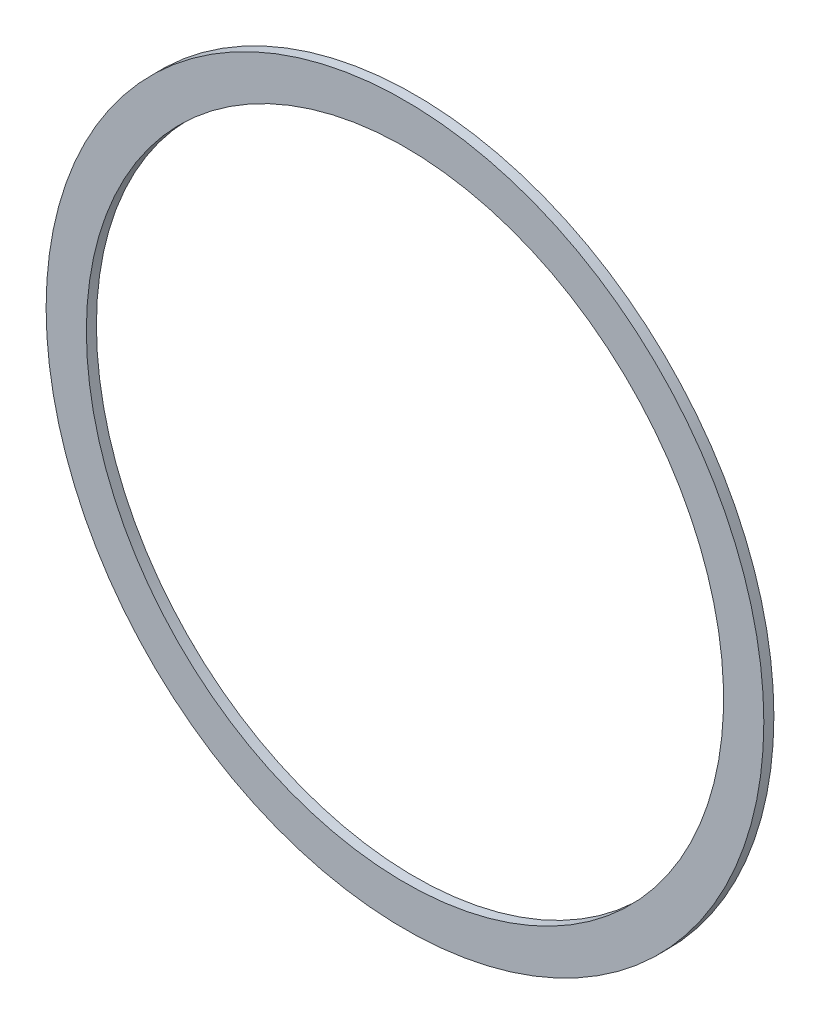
from build123d import *

# Parameters (mm, degrees)
SKETCH1_R          = 27.178
SKETCH1_R_2        = 24.13
BASE_EXTRUDE_DEPTH = 0.762


with BuildPart() as part:
    # Sketch1 → Base-Extrude (new body)
    with BuildSketch(Plane.XY):
        with Locations(Location((0, 0, 0), (0, 0, 180))):
            Circle(SKETCH1_R)
        with Locations(Location((0, 0, 0), (0, 0, 180))):
            Circle(SKETCH1_R_2, mode=Mode.SUBTRACT)
    extrude(amount=BASE_EXTRUDE_DEPTH)


solid = part.part
